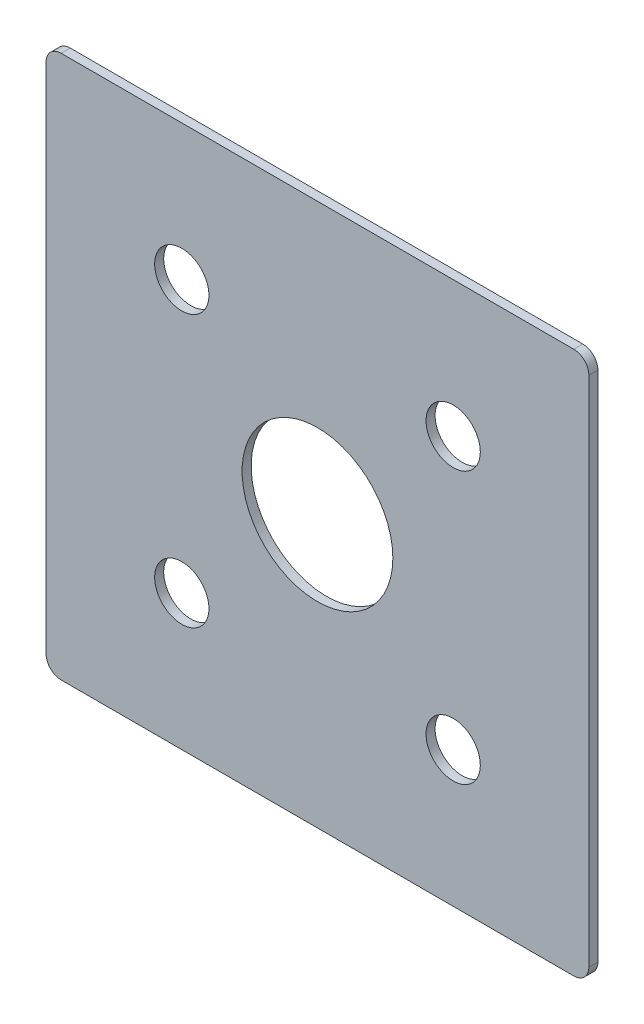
ISO-10303-21;
HEADER;
FILE_DESCRIPTION(('STEP AP214'),'2;1');
FILE_NAME('part.step','',(''),(''),'','','');
FILE_SCHEMA(('AUTOMOTIVE_DESIGN { 1 0 10303 214 1 1 1 1 }'));
ENDSEC;
DATA;
#1=APPLICATION_CONTEXT('core data for automotive mechanical design processes');
#2=APPLICATION_PROTOCOL_DEFINITION('international standard','automotive_design',2000,#1);
#3=PRODUCT_CONTEXT('',#1,'mechanical');
#4=PRODUCT('Part','Part','',(#3));
#5=PRODUCT_RELATED_PRODUCT_CATEGORY('part','',(#4));
#6=PRODUCT_DEFINITION_FORMATION('','',#4);
#7=PRODUCT_DEFINITION_CONTEXT('part definition',#1,'design');
#8=PRODUCT_DEFINITION('design','',#6,#7);
#9=PRODUCT_DEFINITION_SHAPE('','',#8);
#10=(LENGTH_UNIT() NAMED_UNIT(*) SI_UNIT(.MILLI.,.METRE.));
#11=(NAMED_UNIT(*) PLANE_ANGLE_UNIT() SI_UNIT($,.RADIAN.));
#12=(NAMED_UNIT(*) SI_UNIT($,.STERADIAN.) SOLID_ANGLE_UNIT());
#13=UNCERTAINTY_MEASURE_WITH_UNIT(LENGTH_MEASURE(1.E-05),#10,'distance_accuracy_value','');
#14=(GEOMETRIC_REPRESENTATION_CONTEXT(3) GLOBAL_UNCERTAINTY_ASSIGNED_CONTEXT((#13)) GLOBAL_UNIT_ASSIGNED_CONTEXT((#10,
#11,#12)) REPRESENTATION_CONTEXT('',''));
#15=CARTESIAN_POINT('',(0.,0.,0.));
#16=DIRECTION('',(0.,0.,1.));
#17=DIRECTION('',(1.,0.,0.));
#18=AXIS2_PLACEMENT_3D('',#15,#16,#17);
#19=CARTESIAN_POINT('',(0.,0.,0.));
#20=DIRECTION('',(0.,0.,1.));
#21=DIRECTION('',(1.,0.,0.));
#22=AXIS2_PLACEMENT_3D('',#19,#20,#21);
#23=PLANE('',#22);
#24=CARTESIAN_POINT('',(22.5,22.5,0.));
#25=DIRECTION('',(0.,0.,1.));
#26=DIRECTION('',(1.,0.,0.));
#27=AXIS2_PLACEMENT_3D('',#24,#25,#26);
#28=CIRCLE('',#27,4.5);
#29=CARTESIAN_POINT('',(27.,22.5,0.));
#30=VERTEX_POINT('',#29);
#31=EDGE_CURVE('E142',#30,#30,#28,.T.);
#32=ORIENTED_EDGE('',*,*,#31,.T.);
#33=EDGE_LOOP('',(#32));
#34=FACE_BOUND('',#33,.T.);
#35=CARTESIAN_POINT('',(-22.5,22.5,0.));
#36=DIRECTION('',(0.,0.,1.));
#37=DIRECTION('',(1.,0.,0.));
#38=AXIS2_PLACEMENT_3D('',#35,#36,#37);
#39=CIRCLE('',#38,4.5);
#40=CARTESIAN_POINT('',(-18.,22.5,0.));
#41=VERTEX_POINT('',#40);
#42=EDGE_CURVE('E145',#41,#41,#39,.T.);
#43=ORIENTED_EDGE('',*,*,#42,.T.);
#44=EDGE_LOOP('',(#43));
#45=FACE_BOUND('',#44,.T.);
#46=CARTESIAN_POINT('',(22.5,-22.5,0.));
#47=DIRECTION('',(0.,0.,1.));
#48=DIRECTION('',(1.,0.,0.));
#49=AXIS2_PLACEMENT_3D('',#46,#47,#48);
#50=CIRCLE('',#49,4.5);
#51=CARTESIAN_POINT('',(27.,-22.5,0.));
#52=VERTEX_POINT('',#51);
#53=EDGE_CURVE('E148',#52,#52,#50,.T.);
#54=ORIENTED_EDGE('',*,*,#53,.T.);
#55=EDGE_LOOP('',(#54));
#56=FACE_BOUND('',#55,.T.);
#57=CARTESIAN_POINT('',(-22.5,-22.5,0.));
#58=DIRECTION('',(0.,0.,1.));
#59=DIRECTION('',(1.,0.,0.));
#60=AXIS2_PLACEMENT_3D('',#57,#58,#59);
#61=CIRCLE('',#60,4.5);
#62=CARTESIAN_POINT('',(-18.,-22.5,0.));
#63=VERTEX_POINT('',#62);
#64=EDGE_CURVE('E101',#63,#63,#61,.T.);
#65=ORIENTED_EDGE('',*,*,#64,.T.);
#66=EDGE_LOOP('',(#65));
#67=FACE_BOUND('',#66,.T.);
#68=CARTESIAN_POINT('',(0.,0.,0.));
#69=DIRECTION('',(0.,0.,1.));
#70=DIRECTION('',(1.,0.,0.));
#71=AXIS2_PLACEMENT_3D('',#68,#69,#70);
#72=CIRCLE('',#71,12.5);
#73=CARTESIAN_POINT('',(12.5,0.,0.));
#74=VERTEX_POINT('',#73);
#75=EDGE_CURVE('E98',#74,#74,#72,.T.);
#76=ORIENTED_EDGE('',*,*,#75,.T.);
#77=EDGE_LOOP('',(#76));
#78=FACE_BOUND('',#77,.T.);
#79=DIRECTION('',(0.,1.,0.));
#80=VECTOR('',#79,1.);
#81=CARTESIAN_POINT('',(-45.,-45.,0.));
#82=LINE('',#81,#80);
#83=CARTESIAN_POINT('',(-45.,42.5,0.));
#84=VERTEX_POINT('',#83);
#85=CARTESIAN_POINT('',(-45.,-42.5,0.));
#86=VERTEX_POINT('',#85);
#87=EDGE_CURVE('E82',#84,#86,#82,.F.);
#88=ORIENTED_EDGE('',*,*,#87,.F.);
#89=CARTESIAN_POINT('',(-42.4999999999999,42.5,0.));
#90=DIRECTION('',(0.,0.,1.));
#91=DIRECTION('',(1.,0.,0.));
#92=AXIS2_PLACEMENT_3D('',#89,#90,#91);
#93=CIRCLE('',#92,2.5);
#94=CARTESIAN_POINT('',(-42.4999999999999,45.,0.));
#95=VERTEX_POINT('',#94);
#96=EDGE_CURVE('E95',#95,#84,#93,.T.);
#97=ORIENTED_EDGE('',*,*,#96,.F.);
#98=DIRECTION('',(1.,0.,0.));
#99=VECTOR('',#98,1.);
#100=CARTESIAN_POINT('',(-44.9999999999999,45.,0.));
#101=LINE('',#100,#99);
#102=CARTESIAN_POINT('',(42.5,45.,0.));
#103=VERTEX_POINT('',#102);
#104=EDGE_CURVE('E107',#103,#95,#101,.F.);
#105=ORIENTED_EDGE('',*,*,#104,.F.);
#106=CARTESIAN_POINT('',(42.5,42.4999999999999,0.));
#107=DIRECTION('',(0.,0.,1.));
#108=DIRECTION('',(1.,0.,0.));
#109=AXIS2_PLACEMENT_3D('',#106,#107,#108);
#110=CIRCLE('',#109,2.5);
#111=CARTESIAN_POINT('',(45.,42.4999999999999,0.));
#112=VERTEX_POINT('',#111);
#113=EDGE_CURVE('E154',#112,#103,#110,.T.);
#114=ORIENTED_EDGE('',*,*,#113,.F.);
#115=DIRECTION('',(0.,1.,0.));
#116=VECTOR('',#115,1.);
#117=CARTESIAN_POINT('',(45.,44.9999999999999,0.));
#118=LINE('',#117,#116);
#119=CARTESIAN_POINT('',(45.,-42.5,0.));
#120=VERTEX_POINT('',#119);
#121=EDGE_CURVE('E111',#120,#112,#118,.T.);
#122=ORIENTED_EDGE('',*,*,#121,.F.);
#123=CARTESIAN_POINT('',(42.4999999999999,-42.5,0.));
#124=DIRECTION('',(0.,0.,1.));
#125=DIRECTION('',(1.,0.,0.));
#126=AXIS2_PLACEMENT_3D('',#123,#124,#125);
#127=CIRCLE('',#126,2.5);
#128=CARTESIAN_POINT('',(42.4999999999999,-45.,0.));
#129=VERTEX_POINT('',#128);
#130=EDGE_CURVE('E155',#129,#120,#127,.T.);
#131=ORIENTED_EDGE('',*,*,#130,.F.);
#132=DIRECTION('',(1.,0.,0.));
#133=VECTOR('',#132,1.);
#134=CARTESIAN_POINT('',(44.9999999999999,-45.,0.));
#135=LINE('',#134,#133);
#136=CARTESIAN_POINT('',(-42.5,-45.,0.));
#137=VERTEX_POINT('',#136);
#138=EDGE_CURVE('E84',#137,#129,#135,.T.);
#139=ORIENTED_EDGE('',*,*,#138,.F.);
#140=CARTESIAN_POINT('',(-42.5,-42.5,0.));
#141=DIRECTION('',(0.,0.,1.));
#142=DIRECTION('',(1.,0.,0.));
#143=AXIS2_PLACEMENT_3D('',#140,#141,#142);
#144=CIRCLE('',#143,2.5);
#145=EDGE_CURVE('E19',#86,#137,#144,.T.);
#146=ORIENTED_EDGE('',*,*,#145,.F.);
#147=EDGE_LOOP('',(#88,#97,#105,#114,#122,#131,#139,#146));
#148=FACE_BOUND('',#147,.T.);
#149=ADVANCED_FACE('F16',(#34,#45,#56,#67,#78,#148),#23,.F.);
#150=CARTESIAN_POINT('',(-42.5,-42.5,0.));
#151=DIRECTION('',(0.,0.,1.));
#152=DIRECTION('',(1.,0.,0.));
#153=AXIS2_PLACEMENT_3D('',#150,#151,#152);
#154=CYLINDRICAL_SURFACE('',#153,2.5);
#155=ORIENTED_EDGE('',*,*,#145,.T.);
#156=DIRECTION('',(0.,0.,-1.));
#157=VECTOR('',#156,1.);
#158=CARTESIAN_POINT('',(-42.5,-45.,0.));
#159=LINE('',#158,#157);
#160=CARTESIAN_POINT('',(-42.5,-45.,1.5));
#161=VERTEX_POINT('',#160);
#162=EDGE_CURVE('E87',#161,#137,#159,.T.);
#163=ORIENTED_EDGE('',*,*,#162,.F.);
#164=CARTESIAN_POINT('',(-42.5,-42.5,1.5));
#165=DIRECTION('',(0.,0.,1.));
#166=DIRECTION('',(1.,0.,0.));
#167=AXIS2_PLACEMENT_3D('',#164,#165,#166);
#168=CIRCLE('',#167,2.5);
#169=CARTESIAN_POINT('',(-45.,-42.5,1.5));
#170=VERTEX_POINT('',#169);
#171=EDGE_CURVE('E92',#170,#161,#168,.T.);
#172=ORIENTED_EDGE('',*,*,#171,.F.);
#173=DIRECTION('',(0.,0.,1.));
#174=VECTOR('',#173,1.);
#175=CARTESIAN_POINT('',(-45.,-42.5,0.));
#176=LINE('',#175,#174);
#177=EDGE_CURVE('E89',#86,#170,#176,.T.);
#178=ORIENTED_EDGE('',*,*,#177,.F.);
#179=EDGE_LOOP('',(#155,#163,#172,#178));
#180=FACE_BOUND('',#179,.T.);
#181=ADVANCED_FACE('F90',(#180),#154,.T.);
#182=CARTESIAN_POINT('',(44.9999999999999,-45.,0.));
#183=DIRECTION('',(0.,-1.,0.));
#184=DIRECTION('',(0.,0.,-1.));
#185=AXIS2_PLACEMENT_3D('',#182,#183,#184);
#186=PLANE('',#185);
#187=DIRECTION('',(0.,0.,1.));
#188=VECTOR('',#187,1.);
#189=CARTESIAN_POINT('',(42.4999999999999,-45.,0.));
#190=LINE('',#189,#188);
#191=CARTESIAN_POINT('',(42.4999999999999,-45.,1.5));
#192=VERTEX_POINT('',#191);
#193=EDGE_CURVE('E115',#192,#129,#190,.F.);
#194=ORIENTED_EDGE('',*,*,#193,.F.);
#195=DIRECTION('',(1.,0.,0.));
#196=VECTOR('',#195,1.);
#197=CARTESIAN_POINT('',(0.,-45.,1.5));
#198=LINE('',#197,#196);
#199=EDGE_CURVE('E140',#161,#192,#198,.T.);
#200=ORIENTED_EDGE('',*,*,#199,.F.);
#201=ORIENTED_EDGE('',*,*,#162,.T.);
#202=ORIENTED_EDGE('',*,*,#138,.T.);
#203=EDGE_LOOP('',(#194,#200,#201,#202));
#204=FACE_BOUND('',#203,.T.);
#205=ADVANCED_FACE('F192',(#204),#186,.T.);
#206=CARTESIAN_POINT('',(42.4999999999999,-42.5,0.));
#207=DIRECTION('',(0.,0.,1.));
#208=DIRECTION('',(1.,0.,0.));
#209=AXIS2_PLACEMENT_3D('',#206,#207,#208);
#210=CYLINDRICAL_SURFACE('',#209,2.5);
#211=ORIENTED_EDGE('',*,*,#130,.T.);
#212=DIRECTION('',(0.,0.,-1.));
#213=VECTOR('',#212,1.);
#214=CARTESIAN_POINT('',(45.,-42.5,0.));
#215=LINE('',#214,#213);
#216=CARTESIAN_POINT('',(44.9999999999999,-42.5,1.5));
#217=VERTEX_POINT('',#216);
#218=EDGE_CURVE('E114',#217,#120,#215,.T.);
#219=ORIENTED_EDGE('',*,*,#218,.F.);
#220=CARTESIAN_POINT('',(42.4999999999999,-42.5,1.5));
#221=DIRECTION('',(0.,0.,1.));
#222=DIRECTION('',(1.,0.,0.));
#223=AXIS2_PLACEMENT_3D('',#220,#221,#222);
#224=CIRCLE('',#223,2.5);
#225=EDGE_CURVE('E137',#192,#217,#224,.T.);
#226=ORIENTED_EDGE('',*,*,#225,.F.);
#227=ORIENTED_EDGE('',*,*,#193,.T.);
#228=EDGE_LOOP('',(#211,#219,#226,#227));
#229=FACE_BOUND('',#228,.T.);
#230=ADVANCED_FACE('F189',(#229),#210,.T.);
#231=CARTESIAN_POINT('',(45.,44.9999999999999,0.));
#232=DIRECTION('',(1.,0.,0.));
#233=DIRECTION('',(0.,0.,-1.));
#234=AXIS2_PLACEMENT_3D('',#231,#232,#233);
#235=PLANE('',#234);
#236=ORIENTED_EDGE('',*,*,#218,.T.);
#237=ORIENTED_EDGE('',*,*,#121,.T.);
#238=DIRECTION('',(0.,0.,1.));
#239=VECTOR('',#238,1.);
#240=CARTESIAN_POINT('',(45.,42.4999999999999,0.));
#241=LINE('',#240,#239);
#242=CARTESIAN_POINT('',(45.,42.4999999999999,1.5));
#243=VERTEX_POINT('',#242);
#244=EDGE_CURVE('E113',#243,#112,#241,.F.);
#245=ORIENTED_EDGE('',*,*,#244,.F.);
#246=DIRECTION('',(0.,1.,0.));
#247=VECTOR('',#246,1.);
#248=CARTESIAN_POINT('',(44.9999999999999,0.,1.5));
#249=LINE('',#248,#247);
#250=EDGE_CURVE('E136',#217,#243,#249,.T.);
#251=ORIENTED_EDGE('',*,*,#250,.F.);
#252=EDGE_LOOP('',(#236,#237,#245,#251));
#253=FACE_BOUND('',#252,.T.);
#254=ADVANCED_FACE('F188',(#253),#235,.T.);
#255=CARTESIAN_POINT('',(42.5,42.4999999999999,0.));
#256=DIRECTION('',(0.,0.,1.));
#257=DIRECTION('',(1.,0.,0.));
#258=AXIS2_PLACEMENT_3D('',#255,#256,#257);
#259=CYLINDRICAL_SURFACE('',#258,2.5);
#260=ORIENTED_EDGE('',*,*,#113,.T.);
#261=DIRECTION('',(0.,0.,1.));
#262=VECTOR('',#261,1.);
#263=CARTESIAN_POINT('',(42.5,45.,0.));
#264=LINE('',#263,#262);
#265=CARTESIAN_POINT('',(42.5,45.,1.5));
#266=VERTEX_POINT('',#265);
#267=EDGE_CURVE('E110',#266,#103,#264,.F.);
#268=ORIENTED_EDGE('',*,*,#267,.F.);
#269=CARTESIAN_POINT('',(42.5,42.4999999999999,1.5));
#270=DIRECTION('',(0.,0.,1.));
#271=DIRECTION('',(1.,0.,0.));
#272=AXIS2_PLACEMENT_3D('',#269,#270,#271);
#273=CIRCLE('',#272,2.5);
#274=EDGE_CURVE('E133',#243,#266,#273,.T.);
#275=ORIENTED_EDGE('',*,*,#274,.F.);
#276=ORIENTED_EDGE('',*,*,#244,.T.);
#277=EDGE_LOOP('',(#260,#268,#275,#276));
#278=FACE_BOUND('',#277,.T.);
#279=ADVANCED_FACE('F185',(#278),#259,.T.);
#280=CARTESIAN_POINT('',(-44.9999999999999,45.,0.));
#281=DIRECTION('',(0.,1.,0.));
#282=DIRECTION('',(0.,0.,1.));
#283=AXIS2_PLACEMENT_3D('',#280,#281,#282);
#284=PLANE('',#283);
#285=ORIENTED_EDGE('',*,*,#267,.T.);
#286=ORIENTED_EDGE('',*,*,#104,.T.);
#287=DIRECTION('',(0.,0.,1.));
#288=VECTOR('',#287,1.);
#289=CARTESIAN_POINT('',(-42.4999999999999,45.,0.));
#290=LINE('',#289,#288);
#291=CARTESIAN_POINT('',(-42.4999999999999,45.,1.5));
#292=VERTEX_POINT('',#291);
#293=EDGE_CURVE('E109',#292,#95,#290,.F.);
#294=ORIENTED_EDGE('',*,*,#293,.F.);
#295=DIRECTION('',(1.,0.,0.));
#296=VECTOR('',#295,1.);
#297=CARTESIAN_POINT('',(0.,44.9999999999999,1.5));
#298=LINE('',#297,#296);
#299=EDGE_CURVE('E132',#266,#292,#298,.F.);
#300=ORIENTED_EDGE('',*,*,#299,.F.);
#301=EDGE_LOOP('',(#285,#286,#294,#300));
#302=FACE_BOUND('',#301,.T.);
#303=ADVANCED_FACE('F180',(#302),#284,.T.);
#304=CARTESIAN_POINT('',(-42.4999999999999,42.5,0.));
#305=DIRECTION('',(0.,0.,1.));
#306=DIRECTION('',(1.,0.,0.));
#307=AXIS2_PLACEMENT_3D('',#304,#305,#306);
#308=CYLINDRICAL_SURFACE('',#307,2.5);
#309=ORIENTED_EDGE('',*,*,#96,.T.);
#310=DIRECTION('',(0.,0.,1.));
#311=VECTOR('',#310,1.);
#312=CARTESIAN_POINT('',(-45.,42.5,0.));
#313=LINE('',#312,#311);
#314=CARTESIAN_POINT('',(-45.,42.5,1.5));
#315=VERTEX_POINT('',#314);
#316=EDGE_CURVE('E34',#315,#84,#313,.F.);
#317=ORIENTED_EDGE('',*,*,#316,.F.);
#318=CARTESIAN_POINT('',(-42.4999999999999,42.5,1.5));
#319=DIRECTION('',(0.,0.,1.));
#320=DIRECTION('',(1.,0.,0.));
#321=AXIS2_PLACEMENT_3D('',#318,#319,#320);
#322=CIRCLE('',#321,2.5);
#323=EDGE_CURVE('E129',#292,#315,#322,.T.);
#324=ORIENTED_EDGE('',*,*,#323,.F.);
#325=ORIENTED_EDGE('',*,*,#293,.T.);
#326=EDGE_LOOP('',(#309,#317,#324,#325));
#327=FACE_BOUND('',#326,.T.);
#328=ADVANCED_FACE('F178',(#327),#308,.T.);
#329=CARTESIAN_POINT('',(-45.,-45.,0.));
#330=DIRECTION('',(-1.,0.,0.));
#331=DIRECTION('',(0.,0.,1.));
#332=AXIS2_PLACEMENT_3D('',#329,#330,#331);
#333=PLANE('',#332);
#334=ORIENTED_EDGE('',*,*,#316,.T.);
#335=ORIENTED_EDGE('',*,*,#87,.T.);
#336=ORIENTED_EDGE('',*,*,#177,.T.);
#337=DIRECTION('',(0.,1.,0.));
#338=VECTOR('',#337,1.);
#339=CARTESIAN_POINT('',(-44.9999999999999,0.,1.5));
#340=LINE('',#339,#338);
#341=EDGE_CURVE('E128',#315,#170,#340,.F.);
#342=ORIENTED_EDGE('',*,*,#341,.F.);
#343=EDGE_LOOP('',(#334,#335,#336,#342));
#344=FACE_BOUND('',#343,.T.);
#345=ADVANCED_FACE('F97',(#344),#333,.T.);
#346=CARTESIAN_POINT('',(0.,0.,0.));
#347=DIRECTION('',(0.,0.,1.));
#348=DIRECTION('',(1.,0.,0.));
#349=AXIS2_PLACEMENT_3D('',#346,#347,#348);
#350=CYLINDRICAL_SURFACE('',#349,12.5);
#351=ORIENTED_EDGE('',*,*,#75,.F.);
#352=EDGE_LOOP('',(#351));
#353=FACE_BOUND('',#352,.T.);
#354=CARTESIAN_POINT('',(0.,0.,1.5));
#355=DIRECTION('',(0.,0.,1.));
#356=DIRECTION('',(1.,0.,0.));
#357=AXIS2_PLACEMENT_3D('',#354,#355,#356);
#358=CIRCLE('',#357,12.5);
#359=CARTESIAN_POINT('',(12.5,0.,1.5));
#360=VERTEX_POINT('',#359);
#361=EDGE_CURVE('E125',#360,#360,#358,.F.);
#362=ORIENTED_EDGE('',*,*,#361,.F.);
#363=EDGE_LOOP('',(#362));
#364=FACE_BOUND('',#363,.T.);
#365=ADVANCED_FACE('F223',(#353,#364),#350,.F.);
#366=CARTESIAN_POINT('',(-22.5,-22.5,0.));
#367=DIRECTION('',(0.,0.,1.));
#368=DIRECTION('',(1.,0.,0.));
#369=AXIS2_PLACEMENT_3D('',#366,#367,#368);
#370=CYLINDRICAL_SURFACE('',#369,4.5);
#371=ORIENTED_EDGE('',*,*,#64,.F.);
#372=EDGE_LOOP('',(#371));
#373=FACE_BOUND('',#372,.T.);
#374=CARTESIAN_POINT('',(-22.5,-22.5,1.5));
#375=DIRECTION('',(0.,0.,1.));
#376=DIRECTION('',(1.,0.,0.));
#377=AXIS2_PLACEMENT_3D('',#374,#375,#376);
#378=CIRCLE('',#377,4.5);
#379=CARTESIAN_POINT('',(-18.,-22.5,1.5));
#380=VERTEX_POINT('',#379);
#381=EDGE_CURVE('E122',#380,#380,#378,.F.);
#382=ORIENTED_EDGE('',*,*,#381,.F.);
#383=EDGE_LOOP('',(#382));
#384=FACE_BOUND('',#383,.T.);
#385=ADVANCED_FACE('F219',(#373,#384),#370,.F.);
#386=CARTESIAN_POINT('',(22.5,-22.5,0.));
#387=DIRECTION('',(0.,0.,1.));
#388=DIRECTION('',(1.,0.,0.));
#389=AXIS2_PLACEMENT_3D('',#386,#387,#388);
#390=CYLINDRICAL_SURFACE('',#389,4.5);
#391=ORIENTED_EDGE('',*,*,#53,.F.);
#392=EDGE_LOOP('',(#391));
#393=FACE_BOUND('',#392,.T.);
#394=CARTESIAN_POINT('',(22.5,-22.5,1.5));
#395=DIRECTION('',(0.,0.,1.));
#396=DIRECTION('',(1.,0.,0.));
#397=AXIS2_PLACEMENT_3D('',#394,#395,#396);
#398=CIRCLE('',#397,4.5);
#399=CARTESIAN_POINT('',(27.,-22.5,1.5));
#400=VERTEX_POINT('',#399);
#401=EDGE_CURVE('E119',#400,#400,#398,.F.);
#402=ORIENTED_EDGE('',*,*,#401,.F.);
#403=EDGE_LOOP('',(#402));
#404=FACE_BOUND('',#403,.T.);
#405=ADVANCED_FACE('F215',(#393,#404),#390,.F.);
#406=CARTESIAN_POINT('',(-22.5,22.5,0.));
#407=DIRECTION('',(0.,0.,1.));
#408=DIRECTION('',(1.,0.,0.));
#409=AXIS2_PLACEMENT_3D('',#406,#407,#408);
#410=CYLINDRICAL_SURFACE('',#409,4.5);
#411=ORIENTED_EDGE('',*,*,#42,.F.);
#412=EDGE_LOOP('',(#411));
#413=FACE_BOUND('',#412,.T.);
#414=CARTESIAN_POINT('',(-22.5,22.5,1.5));
#415=DIRECTION('',(0.,0.,1.));
#416=DIRECTION('',(1.,0.,0.));
#417=AXIS2_PLACEMENT_3D('',#414,#415,#416);
#418=CIRCLE('',#417,4.5);
#419=CARTESIAN_POINT('',(-18.,22.5,1.5));
#420=VERTEX_POINT('',#419);
#421=EDGE_CURVE('E25',#420,#420,#418,.F.);
#422=ORIENTED_EDGE('',*,*,#421,.F.);
#423=EDGE_LOOP('',(#422));
#424=FACE_BOUND('',#423,.T.);
#425=ADVANCED_FACE('F208',(#413,#424),#410,.F.);
#426=CARTESIAN_POINT('',(22.5,22.5,0.));
#427=DIRECTION('',(0.,0.,1.));
#428=DIRECTION('',(1.,0.,0.));
#429=AXIS2_PLACEMENT_3D('',#426,#427,#428);
#430=CYLINDRICAL_SURFACE('',#429,4.5);
#431=ORIENTED_EDGE('',*,*,#31,.F.);
#432=EDGE_LOOP('',(#431));
#433=FACE_BOUND('',#432,.T.);
#434=CARTESIAN_POINT('',(22.5,22.5,1.5));
#435=DIRECTION('',(0.,0.,1.));
#436=DIRECTION('',(1.,0.,0.));
#437=AXIS2_PLACEMENT_3D('',#434,#435,#436);
#438=CIRCLE('',#437,4.5);
#439=CARTESIAN_POINT('',(27.,22.5,1.5));
#440=VERTEX_POINT('',#439);
#441=EDGE_CURVE('E11',#440,#440,#438,.F.);
#442=ORIENTED_EDGE('',*,*,#441,.F.);
#443=EDGE_LOOP('',(#442));
#444=FACE_BOUND('',#443,.T.);
#445=ADVANCED_FACE('F202',(#433,#444),#430,.F.);
#446=CARTESIAN_POINT('',(0.,0.,1.5));
#447=DIRECTION('',(0.,0.,1.));
#448=DIRECTION('',(1.,0.,0.));
#449=AXIS2_PLACEMENT_3D('',#446,#447,#448);
#450=PLANE('',#449);
#451=ORIENTED_EDGE('',*,*,#441,.T.);
#452=EDGE_LOOP('',(#451));
#453=FACE_BOUND('',#452,.T.);
#454=ORIENTED_EDGE('',*,*,#421,.T.);
#455=EDGE_LOOP('',(#454));
#456=FACE_BOUND('',#455,.T.);
#457=ORIENTED_EDGE('',*,*,#401,.T.);
#458=EDGE_LOOP('',(#457));
#459=FACE_BOUND('',#458,.T.);
#460=ORIENTED_EDGE('',*,*,#381,.T.);
#461=EDGE_LOOP('',(#460));
#462=FACE_BOUND('',#461,.T.);
#463=ORIENTED_EDGE('',*,*,#361,.T.);
#464=EDGE_LOOP('',(#463));
#465=FACE_BOUND('',#464,.T.);
#466=ORIENTED_EDGE('',*,*,#323,.T.);
#467=ORIENTED_EDGE('',*,*,#341,.T.);
#468=ORIENTED_EDGE('',*,*,#171,.T.);
#469=ORIENTED_EDGE('',*,*,#199,.T.);
#470=ORIENTED_EDGE('',*,*,#225,.T.);
#471=ORIENTED_EDGE('',*,*,#250,.T.);
#472=ORIENTED_EDGE('',*,*,#274,.T.);
#473=ORIENTED_EDGE('',*,*,#299,.T.);
#474=EDGE_LOOP('',(#466,#467,#468,#469,#470,#471,#472,#473));
#475=FACE_BOUND('',#474,.T.);
#476=ADVANCED_FACE('F176',(#453,#456,#459,#462,#465,#475),#450,.T.);
#477=CLOSED_SHELL('',(#149,#181,#205,#230,#254,#279,#303,#328,#345,#365,#385,#405,#425,#445,#476));
#478=MANIFOLD_SOLID_BREP('B1',#477);
#479=ADVANCED_BREP_SHAPE_REPRESENTATION('',(#18,#478),#14);
#480=SHAPE_DEFINITION_REPRESENTATION(#9,#479);
ENDSEC;
END-ISO-10303-21;
